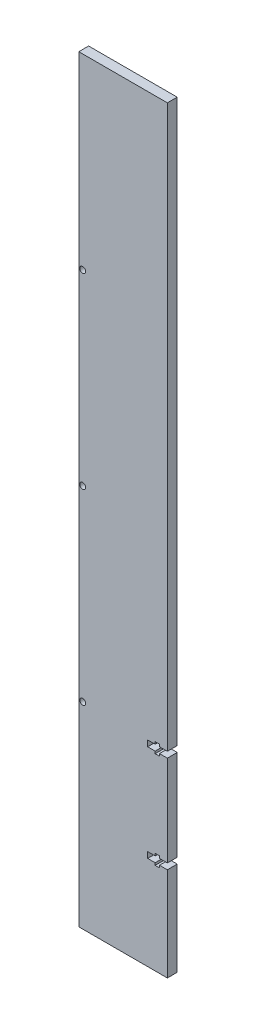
ISO-10303-21;
HEADER;
FILE_DESCRIPTION(('STEP AP214'),'2;1');
FILE_NAME('part.step','',(''),(''),'','','');
FILE_SCHEMA(('AUTOMOTIVE_DESIGN { 1 0 10303 214 1 1 1 1 }'));
ENDSEC;
DATA;
#1=APPLICATION_CONTEXT('core data for automotive mechanical design processes');
#2=APPLICATION_PROTOCOL_DEFINITION('international standard','automotive_design',2000,#1);
#3=PRODUCT_CONTEXT('',#1,'mechanical');
#4=PRODUCT('Part','Part','',(#3));
#5=PRODUCT_RELATED_PRODUCT_CATEGORY('part','',(#4));
#6=PRODUCT_DEFINITION_FORMATION('','',#4);
#7=PRODUCT_DEFINITION_CONTEXT('part definition',#1,'design');
#8=PRODUCT_DEFINITION('design','',#6,#7);
#9=PRODUCT_DEFINITION_SHAPE('','',#8);
#10=(LENGTH_UNIT() NAMED_UNIT(*) SI_UNIT(.MILLI.,.METRE.));
#11=(NAMED_UNIT(*) PLANE_ANGLE_UNIT() SI_UNIT($,.RADIAN.));
#12=(NAMED_UNIT(*) SI_UNIT($,.STERADIAN.) SOLID_ANGLE_UNIT());
#13=UNCERTAINTY_MEASURE_WITH_UNIT(LENGTH_MEASURE(1.E-05),#10,'distance_accuracy_value','');
#14=(GEOMETRIC_REPRESENTATION_CONTEXT(3) GLOBAL_UNCERTAINTY_ASSIGNED_CONTEXT((#13)) GLOBAL_UNIT_ASSIGNED_CONTEXT((#10,
#11,#12)) REPRESENTATION_CONTEXT('',''));
#15=CARTESIAN_POINT('',(0.,0.,0.));
#16=DIRECTION('',(0.,0.,1.));
#17=DIRECTION('',(1.,0.,0.));
#18=AXIS2_PLACEMENT_3D('',#15,#16,#17);
#19=CARTESIAN_POINT('',(18.5,0.,-5.));
#20=DIRECTION('',(1.,0.,0.));
#21=DIRECTION('',(0.,0.,-1.));
#22=AXIS2_PLACEMENT_3D('',#19,#20,#21);
#23=PLANE('',#22);
#24=DIRECTION('',(0.,1.,0.));
#25=VECTOR('',#24,1.);
#26=CARTESIAN_POINT('',(18.5,0.,5.));
#27=LINE('',#26,#25);
#28=CARTESIAN_POINT('',(18.5,-95.7800000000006,5.));
#29=VERTEX_POINT('',#28);
#30=CARTESIAN_POINT('',(18.5,-96.9300000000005,5.));
#31=VERTEX_POINT('',#30);
#32=EDGE_CURVE('E259',#29,#31,#27,.F.);
#33=ORIENTED_EDGE('',*,*,#32,.F.);
#34=DIRECTION('',(0.,0.,1.));
#35=VECTOR('',#34,1.);
#36=CARTESIAN_POINT('',(18.5,-95.7800000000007,-5.));
#37=LINE('',#36,#35);
#38=CARTESIAN_POINT('',(18.5,-95.7800000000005,0.));
#39=VERTEX_POINT('',#38);
#40=EDGE_CURVE('E383',#29,#39,#37,.F.);
#41=ORIENTED_EDGE('',*,*,#40,.T.);
#42=DIRECTION('',(0.,1.,0.));
#43=VECTOR('',#42,1.);
#44=CARTESIAN_POINT('',(18.5,0.,0.));
#45=LINE('',#44,#43);
#46=CARTESIAN_POINT('',(18.5,-96.9300000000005,0.));
#47=VERTEX_POINT('',#46);
#48=EDGE_CURVE('E244',#39,#47,#45,.F.);
#49=ORIENTED_EDGE('',*,*,#48,.T.);
#50=DIRECTION('',(0.,0.,-1.));
#51=VECTOR('',#50,1.);
#52=CARTESIAN_POINT('',(18.5,-96.9300000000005,-5.));
#53=LINE('',#52,#51);
#54=EDGE_CURVE('E377',#47,#31,#53,.F.);
#55=ORIENTED_EDGE('',*,*,#54,.T.);
#56=EDGE_LOOP('',(#33,#41,#49,#55));
#57=FACE_BOUND('',#56,.T.);
#58=ADVANCED_FACE('F25',(#57),#23,.F.);
#59=CARTESIAN_POINT('',(16.2999999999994,0.,-5.));
#60=DIRECTION('',(-1.,0.,0.));
#61=DIRECTION('',(0.,-1.,0.));
#62=AXIS2_PLACEMENT_3D('',#59,#60,#61);
#63=PLANE('',#62);
#64=DIRECTION('',(0.,-1.,0.));
#65=VECTOR('',#64,1.);
#66=CARTESIAN_POINT('',(16.2999999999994,0.,5.));
#67=LINE('',#66,#65);
#68=CARTESIAN_POINT('',(16.3,-96.9300000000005,5.));
#69=VERTEX_POINT('',#68);
#70=CARTESIAN_POINT('',(16.3,-95.7800000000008,5.));
#71=VERTEX_POINT('',#70);
#72=EDGE_CURVE('E257',#69,#71,#67,.F.);
#73=ORIENTED_EDGE('',*,*,#72,.F.);
#74=DIRECTION('',(0.,0.,-1.));
#75=VECTOR('',#74,1.);
#76=CARTESIAN_POINT('',(16.3,-96.9300000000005,-5.));
#77=LINE('',#76,#75);
#78=CARTESIAN_POINT('',(16.3,-96.9300000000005,0.));
#79=VERTEX_POINT('',#78);
#80=EDGE_CURVE('E374',#69,#79,#77,.T.);
#81=ORIENTED_EDGE('',*,*,#80,.T.);
#82=DIRECTION('',(0.,1.,0.));
#83=VECTOR('',#82,1.);
#84=CARTESIAN_POINT('',(16.3,0.,0.));
#85=LINE('',#84,#83);
#86=CARTESIAN_POINT('',(16.3,-95.7800000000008,0.));
#87=VERTEX_POINT('',#86);
#88=EDGE_CURVE('E242',#79,#87,#85,.T.);
#89=ORIENTED_EDGE('',*,*,#88,.T.);
#90=DIRECTION('',(0.,0.,1.));
#91=VECTOR('',#90,1.);
#92=CARTESIAN_POINT('',(16.3,-95.7800000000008,-5.));
#93=LINE('',#92,#91);
#94=EDGE_CURVE('E368',#87,#71,#93,.T.);
#95=ORIENTED_EDGE('',*,*,#94,.T.);
#96=EDGE_LOOP('',(#73,#81,#89,#95));
#97=FACE_BOUND('',#96,.T.);
#98=ADVANCED_FACE('F468',(#97),#63,.F.);
#99=CARTESIAN_POINT('',(16.2999999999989,1.9670255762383E-13,-5.));
#100=DIRECTION('',(-1.,0.,0.));
#101=DIRECTION('',(0.,-1.,0.));
#102=AXIS2_PLACEMENT_3D('',#99,#100,#101);
#103=PLANE('',#102);
#104=DIRECTION('',(0.,-1.,0.));
#105=VECTOR('',#104,1.);
#106=CARTESIAN_POINT('',(16.2999999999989,1.9670255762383E-13,5.));
#107=LINE('',#106,#105);
#108=CARTESIAN_POINT('',(16.3,-92.7800000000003,5.));
#109=VERTEX_POINT('',#108);
#110=CARTESIAN_POINT('',(16.3,-91.6300000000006,5.));
#111=VERTEX_POINT('',#110);
#112=EDGE_CURVE('E255',#109,#111,#107,.F.);
#113=ORIENTED_EDGE('',*,*,#112,.F.);
#114=DIRECTION('',(0.,0.,1.));
#115=VECTOR('',#114,1.);
#116=CARTESIAN_POINT('',(16.3,-92.7800000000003,-5.));
#117=LINE('',#116,#115);
#118=CARTESIAN_POINT('',(16.3,-92.7800000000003,0.));
#119=VERTEX_POINT('',#118);
#120=EDGE_CURVE('E357',#109,#119,#117,.F.);
#121=ORIENTED_EDGE('',*,*,#120,.T.);
#122=DIRECTION('',(0.,1.,0.));
#123=VECTOR('',#122,1.);
#124=CARTESIAN_POINT('',(16.3,0.,0.));
#125=LINE('',#124,#123);
#126=CARTESIAN_POINT('',(16.3,-91.6300000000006,0.));
#127=VERTEX_POINT('',#126);
#128=EDGE_CURVE('E240',#119,#127,#125,.T.);
#129=ORIENTED_EDGE('',*,*,#128,.T.);
#130=DIRECTION('',(0.,0.,1.));
#131=VECTOR('',#130,1.);
#132=CARTESIAN_POINT('',(16.3,-91.6300000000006,-5.));
#133=LINE('',#132,#131);
#134=EDGE_CURVE('E351',#127,#111,#133,.T.);
#135=ORIENTED_EDGE('',*,*,#134,.T.);
#136=EDGE_LOOP('',(#113,#121,#129,#135));
#137=FACE_BOUND('',#136,.T.);
#138=ADVANCED_FACE('F484',(#137),#103,.F.);
#139=CARTESIAN_POINT('',(18.5,0.,-5.));
#140=DIRECTION('',(1.,0.,0.));
#141=DIRECTION('',(0.,0.,-1.));
#142=AXIS2_PLACEMENT_3D('',#139,#140,#141);
#143=PLANE('',#142);
#144=DIRECTION('',(0.,1.,0.));
#145=VECTOR('',#144,1.);
#146=CARTESIAN_POINT('',(18.5,0.,5.));
#147=LINE('',#146,#145);
#148=CARTESIAN_POINT('',(18.5,-91.6300000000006,5.));
#149=VERTEX_POINT('',#148);
#150=CARTESIAN_POINT('',(18.5,-92.7800000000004,5.));
#151=VERTEX_POINT('',#150);
#152=EDGE_CURVE('E253',#149,#151,#147,.F.);
#153=ORIENTED_EDGE('',*,*,#152,.F.);
#154=DIRECTION('',(0.,0.,1.));
#155=VECTOR('',#154,1.);
#156=CARTESIAN_POINT('',(18.5,-91.6300000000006,-5.));
#157=LINE('',#156,#155);
#158=CARTESIAN_POINT('',(18.5,-91.6300000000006,0.));
#159=VERTEX_POINT('',#158);
#160=EDGE_CURVE('E348',#149,#159,#157,.F.);
#161=ORIENTED_EDGE('',*,*,#160,.T.);
#162=DIRECTION('',(0.,1.,0.));
#163=VECTOR('',#162,1.);
#164=CARTESIAN_POINT('',(18.5,0.,0.));
#165=LINE('',#164,#163);
#166=CARTESIAN_POINT('',(18.5,-92.7800000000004,0.));
#167=VERTEX_POINT('',#166);
#168=EDGE_CURVE('E238',#159,#167,#165,.F.);
#169=ORIENTED_EDGE('',*,*,#168,.T.);
#170=DIRECTION('',(0.,0.,1.));
#171=VECTOR('',#170,1.);
#172=CARTESIAN_POINT('',(18.5,-92.7800000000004,-5.));
#173=LINE('',#172,#171);
#174=EDGE_CURVE('E342',#167,#151,#173,.T.);
#175=ORIENTED_EDGE('',*,*,#174,.T.);
#176=EDGE_LOOP('',(#153,#161,#169,#175));
#177=FACE_BOUND('',#176,.T.);
#178=ADVANCED_FACE('F494',(#177),#143,.F.);
#179=CARTESIAN_POINT('',(18.5,0.,-5.));
#180=DIRECTION('',(1.,0.,0.));
#181=DIRECTION('',(0.,0.,-1.));
#182=AXIS2_PLACEMENT_3D('',#179,#180,#181);
#183=PLANE('',#182);
#184=DIRECTION('',(0.,1.,0.));
#185=VECTOR('',#184,1.);
#186=CARTESIAN_POINT('',(18.5,0.,5.));
#187=LINE('',#186,#185);
#188=CARTESIAN_POINT('',(18.5,-144.890000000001,5.));
#189=VERTEX_POINT('',#188);
#190=CARTESIAN_POINT('',(18.5,-146.040000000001,5.));
#191=VERTEX_POINT('',#190);
#192=EDGE_CURVE('E251',#189,#191,#187,.F.);
#193=ORIENTED_EDGE('',*,*,#192,.F.);
#194=DIRECTION('',(0.,0.,1.));
#195=VECTOR('',#194,1.);
#196=CARTESIAN_POINT('',(18.5,-144.890000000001,-5.));
#197=LINE('',#196,#195);
#198=CARTESIAN_POINT('',(18.5,-144.890000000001,0.));
#199=VERTEX_POINT('',#198);
#200=EDGE_CURVE('E311',#189,#199,#197,.F.);
#201=ORIENTED_EDGE('',*,*,#200,.T.);
#202=DIRECTION('',(0.,1.,0.));
#203=VECTOR('',#202,1.);
#204=CARTESIAN_POINT('',(18.5,0.,0.));
#205=LINE('',#204,#203);
#206=CARTESIAN_POINT('',(18.5,-146.040000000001,0.));
#207=VERTEX_POINT('',#206);
#208=EDGE_CURVE('E236',#199,#207,#205,.F.);
#209=ORIENTED_EDGE('',*,*,#208,.T.);
#210=DIRECTION('',(0.,0.,-1.));
#211=VECTOR('',#210,1.);
#212=CARTESIAN_POINT('',(18.5,-146.040000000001,-5.));
#213=LINE('',#212,#211);
#214=EDGE_CURVE('E305',#207,#191,#213,.F.);
#215=ORIENTED_EDGE('',*,*,#214,.T.);
#216=EDGE_LOOP('',(#193,#201,#209,#215));
#217=FACE_BOUND('',#216,.T.);
#218=ADVANCED_FACE('F526',(#217),#183,.F.);
#219=CARTESIAN_POINT('',(16.2999999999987,1.47526918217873E-13,-5.));
#220=DIRECTION('',(-1.,0.,0.));
#221=DIRECTION('',(0.,-1.,0.));
#222=AXIS2_PLACEMENT_3D('',#219,#220,#221);
#223=PLANE('',#222);
#224=DIRECTION('',(0.,-1.,0.));
#225=VECTOR('',#224,1.);
#226=CARTESIAN_POINT('',(16.2999999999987,1.47526918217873E-13,5.));
#227=LINE('',#226,#225);
#228=CARTESIAN_POINT('',(16.3,-146.040000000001,5.));
#229=VERTEX_POINT('',#228);
#230=CARTESIAN_POINT('',(16.3,-144.890000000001,5.));
#231=VERTEX_POINT('',#230);
#232=EDGE_CURVE('E249',#229,#231,#227,.F.);
#233=ORIENTED_EDGE('',*,*,#232,.F.);
#234=DIRECTION('',(0.,0.,-1.));
#235=VECTOR('',#234,1.);
#236=CARTESIAN_POINT('',(16.3,-146.040000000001,-5.));
#237=LINE('',#236,#235);
#238=CARTESIAN_POINT('',(16.3,-146.040000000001,0.));
#239=VERTEX_POINT('',#238);
#240=EDGE_CURVE('E302',#229,#239,#237,.T.);
#241=ORIENTED_EDGE('',*,*,#240,.T.);
#242=DIRECTION('',(0.,1.,0.));
#243=VECTOR('',#242,1.);
#244=CARTESIAN_POINT('',(16.3,0.,0.));
#245=LINE('',#244,#243);
#246=CARTESIAN_POINT('',(16.3,-144.890000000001,0.));
#247=VERTEX_POINT('',#246);
#248=EDGE_CURVE('E234',#239,#247,#245,.T.);
#249=ORIENTED_EDGE('',*,*,#248,.T.);
#250=DIRECTION('',(0.,0.,1.));
#251=VECTOR('',#250,1.);
#252=CARTESIAN_POINT('',(16.3,-144.890000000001,-5.));
#253=LINE('',#252,#251);
#254=EDGE_CURVE('E296',#247,#231,#253,.T.);
#255=ORIENTED_EDGE('',*,*,#254,.T.);
#256=EDGE_LOOP('',(#233,#241,#249,#255));
#257=FACE_BOUND('',#256,.T.);
#258=ADVANCED_FACE('F534',(#257),#223,.F.);
#259=CARTESIAN_POINT('',(16.2999999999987,1.47526918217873E-13,-5.));
#260=DIRECTION('',(-1.,0.,0.));
#261=DIRECTION('',(0.,-1.,0.));
#262=AXIS2_PLACEMENT_3D('',#259,#260,#261);
#263=PLANE('',#262);
#264=DIRECTION('',(0.,-1.,0.));
#265=VECTOR('',#264,1.);
#266=CARTESIAN_POINT('',(16.2999999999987,1.47526918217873E-13,5.));
#267=LINE('',#266,#265);
#268=CARTESIAN_POINT('',(16.3,-141.89,5.));
#269=VERTEX_POINT('',#268);
#270=CARTESIAN_POINT('',(16.3,-140.740000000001,5.));
#271=VERTEX_POINT('',#270);
#272=EDGE_CURVE('E247',#269,#271,#267,.F.);
#273=ORIENTED_EDGE('',*,*,#272,.F.);
#274=DIRECTION('',(0.,0.,1.));
#275=VECTOR('',#274,1.);
#276=CARTESIAN_POINT('',(16.3,-141.89,-5.));
#277=LINE('',#276,#275);
#278=CARTESIAN_POINT('',(16.3,-141.89,0.));
#279=VERTEX_POINT('',#278);
#280=EDGE_CURVE('E285',#269,#279,#277,.F.);
#281=ORIENTED_EDGE('',*,*,#280,.T.);
#282=DIRECTION('',(0.,1.,0.));
#283=VECTOR('',#282,1.);
#284=CARTESIAN_POINT('',(16.3,0.,0.));
#285=LINE('',#284,#283);
#286=CARTESIAN_POINT('',(16.3,-140.740000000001,0.));
#287=VERTEX_POINT('',#286);
#288=EDGE_CURVE('E219',#279,#287,#285,.T.);
#289=ORIENTED_EDGE('',*,*,#288,.T.);
#290=DIRECTION('',(0.,0.,1.));
#291=VECTOR('',#290,1.);
#292=CARTESIAN_POINT('',(16.3,-140.740000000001,-5.));
#293=LINE('',#292,#291);
#294=EDGE_CURVE('E276',#287,#271,#293,.T.);
#295=ORIENTED_EDGE('',*,*,#294,.T.);
#296=EDGE_LOOP('',(#273,#281,#289,#295));
#297=FACE_BOUND('',#296,.T.);
#298=ADVANCED_FACE('F552',(#297),#263,.F.);
#299=CARTESIAN_POINT('',(18.5000000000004,0.,-5.));
#300=DIRECTION('',(1.,0.,0.));
#301=DIRECTION('',(0.,1.,0.));
#302=AXIS2_PLACEMENT_3D('',#299,#300,#301);
#303=PLANE('',#302);
#304=DIRECTION('',(0.,1.,0.));
#305=VECTOR('',#304,1.);
#306=CARTESIAN_POINT('',(18.5000000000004,0.,5.));
#307=LINE('',#306,#305);
#308=CARTESIAN_POINT('',(18.5,-140.740000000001,5.));
#309=VERTEX_POINT('',#308);
#310=CARTESIAN_POINT('',(18.5,-141.89,5.));
#311=VERTEX_POINT('',#310);
#312=EDGE_CURVE('E43',#309,#311,#307,.F.);
#313=ORIENTED_EDGE('',*,*,#312,.F.);
#314=DIRECTION('',(0.,0.,1.));
#315=VECTOR('',#314,1.);
#316=CARTESIAN_POINT('',(18.5,-140.740000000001,-5.));
#317=LINE('',#316,#315);
#318=CARTESIAN_POINT('',(18.5,-140.740000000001,0.));
#319=VERTEX_POINT('',#318);
#320=EDGE_CURVE('E215',#309,#319,#317,.F.);
#321=ORIENTED_EDGE('',*,*,#320,.T.);
#322=DIRECTION('',(0.,1.,0.));
#323=VECTOR('',#322,1.);
#324=CARTESIAN_POINT('',(18.5,0.,0.));
#325=LINE('',#324,#323);
#326=CARTESIAN_POINT('',(18.5,-141.89,0.));
#327=VERTEX_POINT('',#326);
#328=EDGE_CURVE('E210',#319,#327,#325,.F.);
#329=ORIENTED_EDGE('',*,*,#328,.T.);
#330=DIRECTION('',(0.,0.,1.));
#331=VECTOR('',#330,1.);
#332=CARTESIAN_POINT('',(18.5,-141.89,-5.));
#333=LINE('',#332,#331);
#334=EDGE_CURVE('E213',#327,#311,#333,.T.);
#335=ORIENTED_EDGE('',*,*,#334,.T.);
#336=EDGE_LOOP('',(#313,#321,#329,#335));
#337=FACE_BOUND('',#336,.T.);
#338=ADVANCED_FACE('F211',(#337),#303,.F.);
#339=CARTESIAN_POINT('',(0.,0.,0.));
#340=DIRECTION('',(0.,0.,1.));
#341=DIRECTION('',(1.,0.,0.));
#342=AXIS2_PLACEMENT_3D('',#339,#340,#341);
#343=PLANE('',#342);
#344=CARTESIAN_POINT('',(-20.5,2.50000000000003,0.));
#345=DIRECTION('',(0.,0.,-1.));
#346=DIRECTION('',(-1.,0.,0.));
#347=AXIS2_PLACEMENT_3D('',#344,#345,#346);
#348=CIRCLE('',#347,1.50000000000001);
#349=CARTESIAN_POINT('',(-22.,2.50000000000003,0.));
#350=VERTEX_POINT('',#349);
#351=EDGE_CURVE('E267',#350,#350,#348,.F.);
#352=ORIENTED_EDGE('',*,*,#351,.T.);
#353=EDGE_LOOP('',(#352));
#354=FACE_BOUND('',#353,.T.);
#355=CARTESIAN_POINT('',(-20.5,97.5,0.));
#356=DIRECTION('',(0.,0.,-1.));
#357=DIRECTION('',(-1.,0.,0.));
#358=AXIS2_PLACEMENT_3D('',#355,#356,#357);
#359=CIRCLE('',#358,1.50000000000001);
#360=CARTESIAN_POINT('',(-22.,97.5,0.));
#361=VERTEX_POINT('',#360);
#362=EDGE_CURVE('E269',#361,#361,#359,.F.);
#363=ORIENTED_EDGE('',*,*,#362,.T.);
#364=EDGE_LOOP('',(#363));
#365=FACE_BOUND('',#364,.T.);
#366=CARTESIAN_POINT('',(-20.5,-92.5,0.));
#367=DIRECTION('',(0.,0.,-1.));
#368=DIRECTION('',(-1.,0.,0.));
#369=AXIS2_PLACEMENT_3D('',#366,#367,#368);
#370=CIRCLE('',#369,1.5);
#371=CARTESIAN_POINT('',(-22.,-92.5,0.));
#372=VERTEX_POINT('',#371);
#373=EDGE_CURVE('E28',#372,#372,#370,.F.);
#374=ORIENTED_EDGE('',*,*,#373,.T.);
#375=EDGE_LOOP('',(#374));
#376=FACE_BOUND('',#375,.T.);
#377=DIRECTION('',(-1.,-1.73472347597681E-13,0.));
#378=VECTOR('',#377,1.);
#379=CARTESIAN_POINT('',(2.46139914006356E-11,-141.890000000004,0.));
#380=LINE('',#379,#378);
#381=CARTESIAN_POINT('',(22.5,-141.89,0.));
#382=VERTEX_POINT('',#381);
#383=EDGE_CURVE('E218',#382,#327,#380,.T.);
#384=ORIENTED_EDGE('',*,*,#383,.T.);
#385=ORIENTED_EDGE('',*,*,#328,.F.);
#386=DIRECTION('',(1.,0.,0.));
#387=VECTOR('',#386,1.);
#388=CARTESIAN_POINT('',(0.,-140.740000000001,0.));
#389=LINE('',#388,#387);
#390=EDGE_CURVE('E279',#319,#287,#389,.F.);
#391=ORIENTED_EDGE('',*,*,#390,.T.);
#392=ORIENTED_EDGE('',*,*,#288,.F.);
#393=DIRECTION('',(-1.,0.,0.));
#394=VECTOR('',#393,1.);
#395=CARTESIAN_POINT('',(1.0363785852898E-12,-141.89,0.));
#396=LINE('',#395,#394);
#397=CARTESIAN_POINT('',(12.4999999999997,-141.89,0.));
#398=VERTEX_POINT('',#397);
#399=EDGE_CURVE('E290',#279,#398,#396,.T.);
#400=ORIENTED_EDGE('',*,*,#399,.T.);
#401=DIRECTION('',(0.,-1.,0.));
#402=VECTOR('',#401,1.);
#403=CARTESIAN_POINT('',(12.4999999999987,0.,0.));
#404=LINE('',#403,#402);
#405=CARTESIAN_POINT('',(12.4999999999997,-144.890000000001,0.));
#406=VERTEX_POINT('',#405);
#407=EDGE_CURVE('E294',#398,#406,#404,.T.);
#408=ORIENTED_EDGE('',*,*,#407,.T.);
#409=DIRECTION('',(1.,0.,0.));
#410=VECTOR('',#409,1.);
#411=CARTESIAN_POINT('',(1.05829088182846E-12,-144.890000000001,0.));
#412=LINE('',#411,#410);
#413=EDGE_CURVE('E299',#406,#247,#412,.T.);
#414=ORIENTED_EDGE('',*,*,#413,.T.);
#415=ORIENTED_EDGE('',*,*,#248,.F.);
#416=DIRECTION('',(1.,0.,0.));
#417=VECTOR('',#416,1.);
#418=CARTESIAN_POINT('',(0.,-146.040000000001,0.));
#419=LINE('',#418,#417);
#420=EDGE_CURVE('E308',#239,#207,#419,.T.);
#421=ORIENTED_EDGE('',*,*,#420,.T.);
#422=ORIENTED_EDGE('',*,*,#208,.F.);
#423=DIRECTION('',(1.,1.17961196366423E-13,0.));
#424=VECTOR('',#423,1.);
#425=CARTESIAN_POINT('',(1.70913977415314E-11,-144.890000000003,0.));
#426=LINE('',#425,#424);
#427=CARTESIAN_POINT('',(22.5,-144.89,0.));
#428=VERTEX_POINT('',#427);
#429=EDGE_CURVE('E316',#199,#428,#426,.T.);
#430=ORIENTED_EDGE('',*,*,#429,.T.);
#431=DIRECTION('',(0.,-1.,0.));
#432=VECTOR('',#431,1.);
#433=CARTESIAN_POINT('',(22.5,192.5,0.));
#434=LINE('',#433,#432);
#435=CARTESIAN_POINT('',(22.5,-192.5,0.));
#436=VERTEX_POINT('',#435);
#437=EDGE_CURVE('E318',#428,#436,#434,.T.);
#438=ORIENTED_EDGE('',*,*,#437,.T.);
#439=DIRECTION('',(1.,0.,0.));
#440=VECTOR('',#439,1.);
#441=CARTESIAN_POINT('',(-22.5,-192.5,0.));
#442=LINE('',#441,#440);
#443=CARTESIAN_POINT('',(-22.5,-192.5,0.));
#444=VERTEX_POINT('',#443);
#445=EDGE_CURVE('E323',#436,#444,#442,.F.);
#446=ORIENTED_EDGE('',*,*,#445,.T.);
#447=DIRECTION('',(0.,1.,0.));
#448=VECTOR('',#447,1.);
#449=CARTESIAN_POINT('',(-22.5,192.5,0.));
#450=LINE('',#449,#448);
#451=CARTESIAN_POINT('',(-22.5,192.5,0.));
#452=VERTEX_POINT('',#451);
#453=EDGE_CURVE('E328',#444,#452,#450,.T.);
#454=ORIENTED_EDGE('',*,*,#453,.T.);
#455=DIRECTION('',(1.,0.,0.));
#456=VECTOR('',#455,1.);
#457=CARTESIAN_POINT('',(-22.5,192.5,0.));
#458=LINE('',#457,#456);
#459=CARTESIAN_POINT('',(22.5,192.5,0.));
#460=VERTEX_POINT('',#459);
#461=EDGE_CURVE('E333',#452,#460,#458,.T.);
#462=ORIENTED_EDGE('',*,*,#461,.T.);
#463=DIRECTION('',(0.,-1.,0.));
#464=VECTOR('',#463,1.);
#465=CARTESIAN_POINT('',(22.5,192.5,0.));
#466=LINE('',#465,#464);
#467=CARTESIAN_POINT('',(22.5,-92.7800000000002,0.));
#468=VERTEX_POINT('',#467);
#469=EDGE_CURVE('E340',#460,#468,#466,.T.);
#470=ORIENTED_EDGE('',*,*,#469,.T.);
#471=DIRECTION('',(-1.,-1.73472347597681E-13,0.));
#472=VECTOR('',#471,1.);
#473=CARTESIAN_POINT('',(1.60947644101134E-11,-92.7800000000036,0.));
#474=LINE('',#473,#472);
#475=EDGE_CURVE('E345',#468,#167,#474,.T.);
#476=ORIENTED_EDGE('',*,*,#475,.T.);
#477=ORIENTED_EDGE('',*,*,#168,.F.);
#478=DIRECTION('',(1.,0.,0.));
#479=VECTOR('',#478,1.);
#480=CARTESIAN_POINT('',(0.,-91.6300000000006,0.));
#481=LINE('',#480,#479);
#482=EDGE_CURVE('E354',#159,#127,#481,.F.);
#483=ORIENTED_EDGE('',*,*,#482,.T.);
#484=ORIENTED_EDGE('',*,*,#128,.F.);
#485=DIRECTION('',(-1.,0.,0.));
#486=VECTOR('',#485,1.);
#487=CARTESIAN_POINT('',(6.77674290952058E-13,-92.7800000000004,0.));
#488=LINE('',#487,#486);
#489=CARTESIAN_POINT('',(12.4999999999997,-92.7800000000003,0.));
#490=VERTEX_POINT('',#489);
#491=EDGE_CURVE('E362',#119,#490,#488,.T.);
#492=ORIENTED_EDGE('',*,*,#491,.T.);
#493=DIRECTION('',(0.,-1.,0.));
#494=VECTOR('',#493,1.);
#495=CARTESIAN_POINT('',(12.4999999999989,1.0119220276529E-13,0.));
#496=LINE('',#495,#494);
#497=CARTESIAN_POINT('',(12.4999999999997,-95.7800000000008,0.));
#498=VERTEX_POINT('',#497);
#499=EDGE_CURVE('E366',#490,#498,#496,.T.);
#500=ORIENTED_EDGE('',*,*,#499,.T.);
#501=DIRECTION('',(1.,0.,0.));
#502=VECTOR('',#501,1.);
#503=CARTESIAN_POINT('',(6.99586587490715E-13,-95.7800000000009,0.));
#504=LINE('',#503,#502);
#505=EDGE_CURVE('E371',#498,#87,#504,.T.);
#506=ORIENTED_EDGE('',*,*,#505,.T.);
#507=ORIENTED_EDGE('',*,*,#88,.F.);
#508=DIRECTION('',(1.,0.,0.));
#509=VECTOR('',#508,1.);
#510=CARTESIAN_POINT('',(0.,-96.9300000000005,0.));
#511=LINE('',#510,#509);
#512=EDGE_CURVE('E380',#79,#47,#511,.T.);
#513=ORIENTED_EDGE('',*,*,#512,.T.);
#514=ORIENTED_EDGE('',*,*,#48,.F.);
#515=DIRECTION('',(1.,1.17961196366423E-13,0.));
#516=VECTOR('',#515,1.);
#517=CARTESIAN_POINT('',(1.12983233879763E-11,-95.7800000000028,0.));
#518=LINE('',#517,#516);
#519=CARTESIAN_POINT('',(22.5,-95.7800000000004,0.));
#520=VERTEX_POINT('',#519);
#521=EDGE_CURVE('E388',#39,#520,#518,.T.);
#522=ORIENTED_EDGE('',*,*,#521,.T.);
#523=DIRECTION('',(0.,-1.,0.));
#524=VECTOR('',#523,1.);
#525=CARTESIAN_POINT('',(22.5,192.5,0.));
#526=LINE('',#525,#524);
#527=EDGE_CURVE('E207',#520,#382,#526,.T.);
#528=ORIENTED_EDGE('',*,*,#527,.T.);
#529=EDGE_LOOP('',(#384,#385,#391,#392,#400,#408,#414,#415,#421,#422,#430,#438,#446,#454,#462,
#470,#476,#477,#483,#484,#492,#500,#506,#507,#513,#514,#522,#528));
#530=FACE_BOUND('',#529,.T.);
#531=ADVANCED_FACE('F221',(#354,#365,#376,#530),#343,.F.);
#532=CARTESIAN_POINT('',(2.46139914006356E-11,-141.890000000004,-5.));
#533=DIRECTION('',(-1.73472347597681E-13,1.,0.));
#534=DIRECTION('',(-1.,-1.73472347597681E-13,0.));
#535=AXIS2_PLACEMENT_3D('',#532,#533,#534);
#536=PLANE('',#535);
#537=DIRECTION('',(1.,0.,0.));
#538=VECTOR('',#537,1.);
#539=CARTESIAN_POINT('',(0.,-141.89,5.));
#540=LINE('',#539,#538);
#541=CARTESIAN_POINT('',(22.5,-141.89,5.));
#542=VERTEX_POINT('',#541);
#543=EDGE_CURVE('E227',#311,#542,#540,.T.);
#544=ORIENTED_EDGE('',*,*,#543,.F.);
#545=ORIENTED_EDGE('',*,*,#334,.F.);
#546=ORIENTED_EDGE('',*,*,#383,.F.);
#547=DIRECTION('',(0.,0.,1.));
#548=VECTOR('',#547,1.);
#549=CARTESIAN_POINT('',(22.5,-141.89,5.));
#550=LINE('',#549,#548);
#551=EDGE_CURVE('E229',#382,#542,#550,.T.);
#552=ORIENTED_EDGE('',*,*,#551,.T.);
#553=EDGE_LOOP('',(#544,#545,#546,#552));
#554=FACE_BOUND('',#553,.T.);
#555=ADVANCED_FACE('F225',(#554),#536,.F.);
#556=CARTESIAN_POINT('',(22.5,192.5,5.));
#557=DIRECTION('',(-1.,0.,0.));
#558=DIRECTION('',(0.,-1.,0.));
#559=AXIS2_PLACEMENT_3D('',#556,#557,#558);
#560=PLANE('',#559);
#561=ORIENTED_EDGE('',*,*,#551,.F.);
#562=ORIENTED_EDGE('',*,*,#527,.F.);
#563=DIRECTION('',(0.,0.,1.));
#564=VECTOR('',#563,1.);
#565=CARTESIAN_POINT('',(22.5,-95.7800000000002,-5.));
#566=LINE('',#565,#564);
#567=CARTESIAN_POINT('',(22.5,-95.7800000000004,5.));
#568=VERTEX_POINT('',#567);
#569=EDGE_CURVE('E386',#520,#568,#566,.T.);
#570=ORIENTED_EDGE('',*,*,#569,.T.);
#571=DIRECTION('',(0.,1.,0.));
#572=VECTOR('',#571,1.);
#573=CARTESIAN_POINT('',(22.5,0.,5.));
#574=LINE('',#573,#572);
#575=EDGE_CURVE('E392',#542,#568,#574,.T.);
#576=ORIENTED_EDGE('',*,*,#575,.F.);
#577=EDGE_LOOP('',(#561,#562,#570,#576));
#578=FACE_BOUND('',#577,.T.);
#579=ADVANCED_FACE('F393',(#578),#560,.F.);
#580=CARTESIAN_POINT('',(1.12983233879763E-11,-95.7800000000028,-5.));
#581=DIRECTION('',(1.17961196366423E-13,-1.,0.));
#582=DIRECTION('',(1.,1.17961196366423E-13,0.));
#583=AXIS2_PLACEMENT_3D('',#580,#581,#582);
#584=PLANE('',#583);
#585=DIRECTION('',(1.,0.,0.));
#586=VECTOR('',#585,1.);
#587=CARTESIAN_POINT('',(0.,-95.7800000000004,5.));
#588=LINE('',#587,#586);
#589=EDGE_CURVE('E398',#568,#29,#588,.F.);
#590=ORIENTED_EDGE('',*,*,#589,.F.);
#591=ORIENTED_EDGE('',*,*,#569,.F.);
#592=ORIENTED_EDGE('',*,*,#521,.F.);
#593=ORIENTED_EDGE('',*,*,#40,.F.);
#594=EDGE_LOOP('',(#590,#591,#592,#593));
#595=FACE_BOUND('',#594,.T.);
#596=ADVANCED_FACE('F456',(#595),#584,.F.);
#597=CARTESIAN_POINT('',(0.,-96.9300000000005,-5.));
#598=DIRECTION('',(0.,-1.,0.));
#599=DIRECTION('',(0.,0.,-1.));
#600=AXIS2_PLACEMENT_3D('',#597,#598,#599);
#601=PLANE('',#600);
#602=DIRECTION('',(1.,0.,0.));
#603=VECTOR('',#602,1.);
#604=CARTESIAN_POINT('',(0.,-96.9300000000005,5.));
#605=LINE('',#604,#603);
#606=EDGE_CURVE('E451',#31,#69,#605,.F.);
#607=ORIENTED_EDGE('',*,*,#606,.F.);
#608=ORIENTED_EDGE('',*,*,#54,.F.);
#609=ORIENTED_EDGE('',*,*,#512,.F.);
#610=ORIENTED_EDGE('',*,*,#80,.F.);
#611=EDGE_LOOP('',(#607,#608,#609,#610));
#612=FACE_BOUND('',#611,.T.);
#613=ADVANCED_FACE('F464',(#612),#601,.F.);
#614=CARTESIAN_POINT('',(6.99586587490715E-13,-95.7800000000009,-5.));
#615=DIRECTION('',(0.,-1.,0.));
#616=DIRECTION('',(1.,0.,0.));
#617=AXIS2_PLACEMENT_3D('',#614,#615,#616);
#618=PLANE('',#617);
#619=DIRECTION('',(1.,0.,0.));
#620=VECTOR('',#619,1.);
#621=CARTESIAN_POINT('',(0.,-95.7800000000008,5.));
#622=LINE('',#621,#620);
#623=CARTESIAN_POINT('',(12.4999999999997,-95.7800000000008,5.));
#624=VERTEX_POINT('',#623);
#625=EDGE_CURVE('E448',#71,#624,#622,.F.);
#626=ORIENTED_EDGE('',*,*,#625,.F.);
#627=ORIENTED_EDGE('',*,*,#94,.F.);
#628=ORIENTED_EDGE('',*,*,#505,.F.);
#629=DIRECTION('',(0.,0.,1.));
#630=VECTOR('',#629,1.);
#631=CARTESIAN_POINT('',(12.4999999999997,-95.7800000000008,-5.));
#632=LINE('',#631,#630);
#633=EDGE_CURVE('E364',#498,#624,#632,.T.);
#634=ORIENTED_EDGE('',*,*,#633,.T.);
#635=EDGE_LOOP('',(#626,#627,#628,#634));
#636=FACE_BOUND('',#635,.T.);
#637=ADVANCED_FACE('F471',(#636),#618,.F.);
#638=CARTESIAN_POINT('',(12.4999999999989,1.0119220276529E-13,-5.));
#639=DIRECTION('',(-1.,0.,0.));
#640=DIRECTION('',(0.,-1.,0.));
#641=AXIS2_PLACEMENT_3D('',#638,#639,#640);
#642=PLANE('',#641);
#643=DIRECTION('',(0.,1.,0.));
#644=VECTOR('',#643,1.);
#645=CARTESIAN_POINT('',(12.4999999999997,0.,5.));
#646=LINE('',#645,#644);
#647=CARTESIAN_POINT('',(12.4999999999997,-92.7800000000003,5.));
#648=VERTEX_POINT('',#647);
#649=EDGE_CURVE('E445',#624,#648,#646,.T.);
#650=ORIENTED_EDGE('',*,*,#649,.F.);
#651=ORIENTED_EDGE('',*,*,#633,.F.);
#652=ORIENTED_EDGE('',*,*,#499,.F.);
#653=DIRECTION('',(0.,0.,1.));
#654=VECTOR('',#653,1.);
#655=CARTESIAN_POINT('',(12.4999999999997,-92.7800000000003,-5.));
#656=LINE('',#655,#654);
#657=EDGE_CURVE('E360',#490,#648,#656,.T.);
#658=ORIENTED_EDGE('',*,*,#657,.T.);
#659=EDGE_LOOP('',(#650,#651,#652,#658));
#660=FACE_BOUND('',#659,.T.);
#661=ADVANCED_FACE('F476',(#660),#642,.F.);
#662=CARTESIAN_POINT('',(6.77674290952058E-13,-92.7800000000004,-5.));
#663=DIRECTION('',(0.,1.,0.));
#664=DIRECTION('',(-1.,0.,0.));
#665=AXIS2_PLACEMENT_3D('',#662,#663,#664);
#666=PLANE('',#665);
#667=DIRECTION('',(1.,0.,0.));
#668=VECTOR('',#667,1.);
#669=CARTESIAN_POINT('',(0.,-92.7800000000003,5.));
#670=LINE('',#669,#668);
#671=EDGE_CURVE('E442',#648,#109,#670,.T.);
#672=ORIENTED_EDGE('',*,*,#671,.F.);
#673=ORIENTED_EDGE('',*,*,#657,.F.);
#674=ORIENTED_EDGE('',*,*,#491,.F.);
#675=ORIENTED_EDGE('',*,*,#120,.F.);
#676=EDGE_LOOP('',(#672,#673,#674,#675));
#677=FACE_BOUND('',#676,.T.);
#678=ADVANCED_FACE('F481',(#677),#666,.F.);
#679=CARTESIAN_POINT('',(0.,-91.6300000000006,-5.));
#680=DIRECTION('',(0.,1.,0.));
#681=DIRECTION('',(0.,0.,1.));
#682=AXIS2_PLACEMENT_3D('',#679,#680,#681);
#683=PLANE('',#682);
#684=DIRECTION('',(1.,0.,0.));
#685=VECTOR('',#684,1.);
#686=CARTESIAN_POINT('',(0.,-91.6300000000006,5.));
#687=LINE('',#686,#685);
#688=EDGE_CURVE('E439',#111,#149,#687,.T.);
#689=ORIENTED_EDGE('',*,*,#688,.F.);
#690=ORIENTED_EDGE('',*,*,#134,.F.);
#691=ORIENTED_EDGE('',*,*,#482,.F.);
#692=ORIENTED_EDGE('',*,*,#160,.F.);
#693=EDGE_LOOP('',(#689,#690,#691,#692));
#694=FACE_BOUND('',#693,.T.);
#695=ADVANCED_FACE('F490',(#694),#683,.F.);
#696=CARTESIAN_POINT('',(1.60947644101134E-11,-92.7800000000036,-5.));
#697=DIRECTION('',(-1.73472347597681E-13,1.,0.));
#698=DIRECTION('',(-1.,-1.73472347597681E-13,0.));
#699=AXIS2_PLACEMENT_3D('',#696,#697,#698);
#700=PLANE('',#699);
#701=DIRECTION('',(1.,0.,0.));
#702=VECTOR('',#701,1.);
#703=CARTESIAN_POINT('',(0.,-92.7800000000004,5.));
#704=LINE('',#703,#702);
#705=CARTESIAN_POINT('',(22.5,-92.78,5.));
#706=VERTEX_POINT('',#705);
#707=EDGE_CURVE('E436',#151,#706,#704,.T.);
#708=ORIENTED_EDGE('',*,*,#707,.F.);
#709=ORIENTED_EDGE('',*,*,#174,.F.);
#710=ORIENTED_EDGE('',*,*,#475,.F.);
#711=DIRECTION('',(0.,0.,1.));
#712=VECTOR('',#711,1.);
#713=CARTESIAN_POINT('',(22.5,-92.7800000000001,5.));
#714=LINE('',#713,#712);
#715=EDGE_CURVE('E338',#468,#706,#714,.T.);
#716=ORIENTED_EDGE('',*,*,#715,.T.);
#717=EDGE_LOOP('',(#708,#709,#710,#716));
#718=FACE_BOUND('',#717,.T.);
#719=ADVANCED_FACE('F497',(#718),#700,.F.);
#720=CARTESIAN_POINT('',(22.5,192.5,5.));
#721=DIRECTION('',(-1.,0.,0.));
#722=DIRECTION('',(0.,-1.,0.));
#723=AXIS2_PLACEMENT_3D('',#720,#721,#722);
#724=PLANE('',#723);
#725=ORIENTED_EDGE('',*,*,#715,.F.);
#726=ORIENTED_EDGE('',*,*,#469,.F.);
#727=DIRECTION('',(0.,0.,-1.));
#728=VECTOR('',#727,1.);
#729=CARTESIAN_POINT('',(22.5,192.5,5.));
#730=LINE('',#729,#728);
#731=CARTESIAN_POINT('',(22.5,192.5,5.));
#732=VERTEX_POINT('',#731);
#733=EDGE_CURVE('E336',#460,#732,#730,.F.);
#734=ORIENTED_EDGE('',*,*,#733,.T.);
#735=DIRECTION('',(0.,1.,0.));
#736=VECTOR('',#735,1.);
#737=CARTESIAN_POINT('',(22.5,0.,5.));
#738=LINE('',#737,#736);
#739=EDGE_CURVE('E433',#706,#732,#738,.T.);
#740=ORIENTED_EDGE('',*,*,#739,.F.);
#741=EDGE_LOOP('',(#725,#726,#734,#740));
#742=FACE_BOUND('',#741,.T.);
#743=ADVANCED_FACE('F501',(#742),#724,.F.);
#744=CARTESIAN_POINT('',(-22.5,192.5,5.));
#745=DIRECTION('',(0.,-1.,0.));
#746=DIRECTION('',(0.,0.,-1.));
#747=AXIS2_PLACEMENT_3D('',#744,#745,#746);
#748=PLANE('',#747);
#749=DIRECTION('',(0.,0.,1.));
#750=VECTOR('',#749,1.);
#751=CARTESIAN_POINT('',(-22.5,192.5,5.));
#752=LINE('',#751,#750);
#753=CARTESIAN_POINT('',(-22.5,192.5,5.));
#754=VERTEX_POINT('',#753);
#755=EDGE_CURVE('E331',#452,#754,#752,.T.);
#756=ORIENTED_EDGE('',*,*,#755,.T.);
#757=DIRECTION('',(1.,0.,0.));
#758=VECTOR('',#757,1.);
#759=CARTESIAN_POINT('',(0.,192.5,5.));
#760=LINE('',#759,#758);
#761=EDGE_CURVE('E430',#732,#754,#760,.F.);
#762=ORIENTED_EDGE('',*,*,#761,.F.);
#763=ORIENTED_EDGE('',*,*,#733,.F.);
#764=ORIENTED_EDGE('',*,*,#461,.F.);
#765=EDGE_LOOP('',(#756,#762,#763,#764));
#766=FACE_BOUND('',#765,.T.);
#767=ADVANCED_FACE('F506',(#766),#748,.F.);
#768=CARTESIAN_POINT('',(-22.5,192.5,5.));
#769=DIRECTION('',(1.,0.,0.));
#770=DIRECTION('',(0.,1.,0.));
#771=AXIS2_PLACEMENT_3D('',#768,#769,#770);
#772=PLANE('',#771);
#773=DIRECTION('',(0.,0.,1.));
#774=VECTOR('',#773,1.);
#775=CARTESIAN_POINT('',(-22.5,-192.5,5.));
#776=LINE('',#775,#774);
#777=CARTESIAN_POINT('',(-22.5,-192.5,5.));
#778=VERTEX_POINT('',#777);
#779=EDGE_CURVE('E326',#444,#778,#776,.T.);
#780=ORIENTED_EDGE('',*,*,#779,.T.);
#781=DIRECTION('',(0.,1.,0.));
#782=VECTOR('',#781,1.);
#783=CARTESIAN_POINT('',(-22.5,0.,5.));
#784=LINE('',#783,#782);
#785=EDGE_CURVE('E427',#754,#778,#784,.F.);
#786=ORIENTED_EDGE('',*,*,#785,.F.);
#787=ORIENTED_EDGE('',*,*,#755,.F.);
#788=ORIENTED_EDGE('',*,*,#453,.F.);
#789=EDGE_LOOP('',(#780,#786,#787,#788));
#790=FACE_BOUND('',#789,.T.);
#791=ADVANCED_FACE('F509',(#790),#772,.F.);
#792=CARTESIAN_POINT('',(-22.5,-192.5,5.));
#793=DIRECTION('',(0.,1.,0.));
#794=DIRECTION('',(0.,0.,1.));
#795=AXIS2_PLACEMENT_3D('',#792,#793,#794);
#796=PLANE('',#795);
#797=DIRECTION('',(0.,0.,1.));
#798=VECTOR('',#797,1.);
#799=CARTESIAN_POINT('',(22.5,-192.5,5.));
#800=LINE('',#799,#798);
#801=CARTESIAN_POINT('',(22.5,-192.5,5.));
#802=VERTEX_POINT('',#801);
#803=EDGE_CURVE('E321',#436,#802,#800,.T.);
#804=ORIENTED_EDGE('',*,*,#803,.T.);
#805=DIRECTION('',(1.,0.,0.));
#806=VECTOR('',#805,1.);
#807=CARTESIAN_POINT('',(0.,-192.5,5.));
#808=LINE('',#807,#806);
#809=EDGE_CURVE('E424',#778,#802,#808,.T.);
#810=ORIENTED_EDGE('',*,*,#809,.F.);
#811=ORIENTED_EDGE('',*,*,#779,.F.);
#812=ORIENTED_EDGE('',*,*,#445,.F.);
#813=EDGE_LOOP('',(#804,#810,#811,#812));
#814=FACE_BOUND('',#813,.T.);
#815=ADVANCED_FACE('F513',(#814),#796,.F.);
#816=CARTESIAN_POINT('',(22.5,192.5,5.));
#817=DIRECTION('',(-1.,0.,0.));
#818=DIRECTION('',(0.,-1.,0.));
#819=AXIS2_PLACEMENT_3D('',#816,#817,#818);
#820=PLANE('',#819);
#821=DIRECTION('',(0.,0.,1.));
#822=VECTOR('',#821,1.);
#823=CARTESIAN_POINT('',(22.5,-144.89,-5.));
#824=LINE('',#823,#822);
#825=CARTESIAN_POINT('',(22.5,-144.89,5.));
#826=VERTEX_POINT('',#825);
#827=EDGE_CURVE('E314',#428,#826,#824,.T.);
#828=ORIENTED_EDGE('',*,*,#827,.T.);
#829=DIRECTION('',(0.,1.,0.));
#830=VECTOR('',#829,1.);
#831=CARTESIAN_POINT('',(22.5,0.,5.));
#832=LINE('',#831,#830);
#833=EDGE_CURVE('E421',#802,#826,#832,.T.);
#834=ORIENTED_EDGE('',*,*,#833,.F.);
#835=ORIENTED_EDGE('',*,*,#803,.F.);
#836=ORIENTED_EDGE('',*,*,#437,.F.);
#837=EDGE_LOOP('',(#828,#834,#835,#836));
#838=FACE_BOUND('',#837,.T.);
#839=ADVANCED_FACE('F518',(#838),#820,.F.);
#840=CARTESIAN_POINT('',(1.70913977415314E-11,-144.890000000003,-5.));
#841=DIRECTION('',(1.17961196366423E-13,-1.,0.));
#842=DIRECTION('',(1.,1.17961196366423E-13,0.));
#843=AXIS2_PLACEMENT_3D('',#840,#841,#842);
#844=PLANE('',#843);
#845=DIRECTION('',(1.,0.,0.));
#846=VECTOR('',#845,1.);
#847=CARTESIAN_POINT('',(0.,-144.89,5.));
#848=LINE('',#847,#846);
#849=EDGE_CURVE('E418',#826,#189,#848,.F.);
#850=ORIENTED_EDGE('',*,*,#849,.F.);
#851=ORIENTED_EDGE('',*,*,#827,.F.);
#852=ORIENTED_EDGE('',*,*,#429,.F.);
#853=ORIENTED_EDGE('',*,*,#200,.F.);
#854=EDGE_LOOP('',(#850,#851,#852,#853));
#855=FACE_BOUND('',#854,.T.);
#856=ADVANCED_FACE('F524',(#855),#844,.F.);
#857=CARTESIAN_POINT('',(0.,-146.040000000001,-5.));
#858=DIRECTION('',(0.,-1.,0.));
#859=DIRECTION('',(0.,0.,-1.));
#860=AXIS2_PLACEMENT_3D('',#857,#858,#859);
#861=PLANE('',#860);
#862=DIRECTION('',(1.,0.,0.));
#863=VECTOR('',#862,1.);
#864=CARTESIAN_POINT('',(0.,-146.040000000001,5.));
#865=LINE('',#864,#863);
#866=EDGE_CURVE('E415',#191,#229,#865,.F.);
#867=ORIENTED_EDGE('',*,*,#866,.F.);
#868=ORIENTED_EDGE('',*,*,#214,.F.);
#869=ORIENTED_EDGE('',*,*,#420,.F.);
#870=ORIENTED_EDGE('',*,*,#240,.F.);
#871=EDGE_LOOP('',(#867,#868,#869,#870));
#872=FACE_BOUND('',#871,.T.);
#873=ADVANCED_FACE('F531',(#872),#861,.F.);
#874=CARTESIAN_POINT('',(1.05829088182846E-12,-144.890000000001,-5.));
#875=DIRECTION('',(0.,-1.,0.));
#876=DIRECTION('',(1.,0.,0.));
#877=AXIS2_PLACEMENT_3D('',#874,#875,#876);
#878=PLANE('',#877);
#879=DIRECTION('',(1.,0.,0.));
#880=VECTOR('',#879,1.);
#881=CARTESIAN_POINT('',(0.,-144.890000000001,5.));
#882=LINE('',#881,#880);
#883=CARTESIAN_POINT('',(12.4999999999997,-144.890000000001,5.));
#884=VERTEX_POINT('',#883);
#885=EDGE_CURVE('E412',#231,#884,#882,.F.);
#886=ORIENTED_EDGE('',*,*,#885,.F.);
#887=ORIENTED_EDGE('',*,*,#254,.F.);
#888=ORIENTED_EDGE('',*,*,#413,.F.);
#889=DIRECTION('',(0.,0.,1.));
#890=VECTOR('',#889,1.);
#891=CARTESIAN_POINT('',(12.4999999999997,-144.890000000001,-5.));
#892=LINE('',#891,#890);
#893=EDGE_CURVE('E292',#406,#884,#892,.T.);
#894=ORIENTED_EDGE('',*,*,#893,.T.);
#895=EDGE_LOOP('',(#886,#887,#888,#894));
#896=FACE_BOUND('',#895,.T.);
#897=ADVANCED_FACE('F539',(#896),#878,.F.);
#898=CARTESIAN_POINT('',(12.4999999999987,0.,-5.));
#899=DIRECTION('',(-1.,0.,0.));
#900=DIRECTION('',(0.,-1.,0.));
#901=AXIS2_PLACEMENT_3D('',#898,#899,#900);
#902=PLANE('',#901);
#903=DIRECTION('',(0.,1.,0.));
#904=VECTOR('',#903,1.);
#905=CARTESIAN_POINT('',(12.4999999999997,0.,5.));
#906=LINE('',#905,#904);
#907=CARTESIAN_POINT('',(12.4999999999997,-141.89,5.));
#908=VERTEX_POINT('',#907);
#909=EDGE_CURVE('E407',#884,#908,#906,.T.);
#910=ORIENTED_EDGE('',*,*,#909,.F.);
#911=ORIENTED_EDGE('',*,*,#893,.F.);
#912=ORIENTED_EDGE('',*,*,#407,.F.);
#913=DIRECTION('',(0.,0.,1.));
#914=VECTOR('',#913,1.);
#915=CARTESIAN_POINT('',(12.4999999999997,-141.89,-5.));
#916=LINE('',#915,#914);
#917=EDGE_CURVE('E288',#398,#908,#916,.T.);
#918=ORIENTED_EDGE('',*,*,#917,.T.);
#919=EDGE_LOOP('',(#910,#911,#912,#918));
#920=FACE_BOUND('',#919,.T.);
#921=ADVANCED_FACE('F544',(#920),#902,.F.);
#922=CARTESIAN_POINT('',(1.0363785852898E-12,-141.89,-5.));
#923=DIRECTION('',(0.,1.,0.));
#924=DIRECTION('',(-1.,0.,0.));
#925=AXIS2_PLACEMENT_3D('',#922,#923,#924);
#926=PLANE('',#925);
#927=DIRECTION('',(1.,0.,0.));
#928=VECTOR('',#927,1.);
#929=CARTESIAN_POINT('',(0.,-141.89,5.));
#930=LINE('',#929,#928);
#931=EDGE_CURVE('E405',#908,#269,#930,.T.);
#932=ORIENTED_EDGE('',*,*,#931,.F.);
#933=ORIENTED_EDGE('',*,*,#917,.F.);
#934=ORIENTED_EDGE('',*,*,#399,.F.);
#935=ORIENTED_EDGE('',*,*,#280,.F.);
#936=EDGE_LOOP('',(#932,#933,#934,#935));
#937=FACE_BOUND('',#936,.T.);
#938=ADVANCED_FACE('F550',(#937),#926,.F.);
#939=CARTESIAN_POINT('',(0.,-140.740000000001,-5.));
#940=DIRECTION('',(0.,1.,0.));
#941=DIRECTION('',(0.,0.,1.));
#942=AXIS2_PLACEMENT_3D('',#939,#940,#941);
#943=PLANE('',#942);
#944=DIRECTION('',(1.,0.,0.));
#945=VECTOR('',#944,1.);
#946=CARTESIAN_POINT('',(0.,-140.740000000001,5.));
#947=LINE('',#946,#945);
#948=EDGE_CURVE('E266',#271,#309,#947,.T.);
#949=ORIENTED_EDGE('',*,*,#948,.F.);
#950=ORIENTED_EDGE('',*,*,#294,.F.);
#951=ORIENTED_EDGE('',*,*,#390,.F.);
#952=ORIENTED_EDGE('',*,*,#320,.F.);
#953=EDGE_LOOP('',(#949,#950,#951,#952));
#954=FACE_BOUND('',#953,.T.);
#955=ADVANCED_FACE('F553',(#954),#943,.F.);
#956=CARTESIAN_POINT('',(-20.5,-92.5,5.));
#957=DIRECTION('',(0.,0.,-1.));
#958=DIRECTION('',(-1.,0.,0.));
#959=AXIS2_PLACEMENT_3D('',#956,#957,#958);
#960=CYLINDRICAL_SURFACE('',#959,1.5);
#961=ORIENTED_EDGE('',*,*,#373,.F.);
#962=EDGE_LOOP('',(#961));
#963=FACE_BOUND('',#962,.T.);
#964=CARTESIAN_POINT('',(-20.5,-92.5,5.));
#965=DIRECTION('',(0.,0.,-1.));
#966=DIRECTION('',(-1.,0.,0.));
#967=AXIS2_PLACEMENT_3D('',#964,#965,#966);
#968=CIRCLE('',#967,1.5);
#969=CARTESIAN_POINT('',(-22.,-92.5,5.));
#970=VERTEX_POINT('',#969);
#971=EDGE_CURVE('E263',#970,#970,#968,.T.);
#972=ORIENTED_EDGE('',*,*,#971,.F.);
#973=EDGE_LOOP('',(#972));
#974=FACE_BOUND('',#973,.T.);
#975=ADVANCED_FACE('F555',(#963,#974),#960,.F.);
#976=CARTESIAN_POINT('',(-20.5,97.5,5.));
#977=DIRECTION('',(0.,0.,-1.));
#978=DIRECTION('',(-1.,0.,0.));
#979=AXIS2_PLACEMENT_3D('',#976,#977,#978);
#980=CYLINDRICAL_SURFACE('',#979,1.50000000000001);
#981=ORIENTED_EDGE('',*,*,#362,.F.);
#982=EDGE_LOOP('',(#981));
#983=FACE_BOUND('',#982,.T.);
#984=CARTESIAN_POINT('',(-20.5,97.5,5.));
#985=DIRECTION('',(0.,0.,-1.));
#986=DIRECTION('',(-1.,0.,0.));
#987=AXIS2_PLACEMENT_3D('',#984,#985,#986);
#988=CIRCLE('',#987,1.50000000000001);
#989=CARTESIAN_POINT('',(-22.,97.5,5.));
#990=VERTEX_POINT('',#989);
#991=EDGE_CURVE('E34',#990,#990,#988,.T.);
#992=ORIENTED_EDGE('',*,*,#991,.F.);
#993=EDGE_LOOP('',(#992));
#994=FACE_BOUND('',#993,.T.);
#995=ADVANCED_FACE('F562',(#983,#994),#980,.F.);
#996=CARTESIAN_POINT('',(-20.5,2.50000000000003,5.));
#997=DIRECTION('',(0.,0.,-1.));
#998=DIRECTION('',(-1.,0.,0.));
#999=AXIS2_PLACEMENT_3D('',#996,#997,#998);
#1000=CYLINDRICAL_SURFACE('',#999,1.50000000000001);
#1001=ORIENTED_EDGE('',*,*,#351,.F.);
#1002=EDGE_LOOP('',(#1001));
#1003=FACE_BOUND('',#1002,.T.);
#1004=CARTESIAN_POINT('',(-20.5,2.50000000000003,5.));
#1005=DIRECTION('',(0.,0.,-1.));
#1006=DIRECTION('',(-1.,0.,0.));
#1007=AXIS2_PLACEMENT_3D('',#1004,#1005,#1006);
#1008=CIRCLE('',#1007,1.50000000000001);
#1009=CARTESIAN_POINT('',(-22.,2.50000000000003,5.));
#1010=VERTEX_POINT('',#1009);
#1011=EDGE_CURVE('E13',#1010,#1010,#1008,.T.);
#1012=ORIENTED_EDGE('',*,*,#1011,.F.);
#1013=EDGE_LOOP('',(#1012));
#1014=FACE_BOUND('',#1013,.T.);
#1015=ADVANCED_FACE('F567',(#1003,#1014),#1000,.F.);
#1016=CARTESIAN_POINT('',(0.,0.,5.));
#1017=DIRECTION('',(0.,0.,1.));
#1018=DIRECTION('',(1.,0.,0.));
#1019=AXIS2_PLACEMENT_3D('',#1016,#1017,#1018);
#1020=PLANE('',#1019);
#1021=ORIENTED_EDGE('',*,*,#1011,.T.);
#1022=EDGE_LOOP('',(#1021));
#1023=FACE_BOUND('',#1022,.T.);
#1024=ORIENTED_EDGE('',*,*,#991,.T.);
#1025=EDGE_LOOP('',(#1024));
#1026=FACE_BOUND('',#1025,.T.);
#1027=ORIENTED_EDGE('',*,*,#971,.T.);
#1028=EDGE_LOOP('',(#1027));
#1029=FACE_BOUND('',#1028,.T.);
#1030=ORIENTED_EDGE('',*,*,#948,.T.);
#1031=ORIENTED_EDGE('',*,*,#312,.T.);
#1032=ORIENTED_EDGE('',*,*,#543,.T.);
#1033=ORIENTED_EDGE('',*,*,#575,.T.);
#1034=ORIENTED_EDGE('',*,*,#589,.T.);
#1035=ORIENTED_EDGE('',*,*,#32,.T.);
#1036=ORIENTED_EDGE('',*,*,#606,.T.);
#1037=ORIENTED_EDGE('',*,*,#72,.T.);
#1038=ORIENTED_EDGE('',*,*,#625,.T.);
#1039=ORIENTED_EDGE('',*,*,#649,.T.);
#1040=ORIENTED_EDGE('',*,*,#671,.T.);
#1041=ORIENTED_EDGE('',*,*,#112,.T.);
#1042=ORIENTED_EDGE('',*,*,#688,.T.);
#1043=ORIENTED_EDGE('',*,*,#152,.T.);
#1044=ORIENTED_EDGE('',*,*,#707,.T.);
#1045=ORIENTED_EDGE('',*,*,#739,.T.);
#1046=ORIENTED_EDGE('',*,*,#761,.T.);
#1047=ORIENTED_EDGE('',*,*,#785,.T.);
#1048=ORIENTED_EDGE('',*,*,#809,.T.);
#1049=ORIENTED_EDGE('',*,*,#833,.T.);
#1050=ORIENTED_EDGE('',*,*,#849,.T.);
#1051=ORIENTED_EDGE('',*,*,#192,.T.);
#1052=ORIENTED_EDGE('',*,*,#866,.T.);
#1053=ORIENTED_EDGE('',*,*,#232,.T.);
#1054=ORIENTED_EDGE('',*,*,#885,.T.);
#1055=ORIENTED_EDGE('',*,*,#909,.T.);
#1056=ORIENTED_EDGE('',*,*,#931,.T.);
#1057=ORIENTED_EDGE('',*,*,#272,.T.);
#1058=EDGE_LOOP('',(#1030,#1031,#1032,#1033,#1034,#1035,#1036,#1037,#1038,#1039,#1040,#1041,
#1042,#1043,#1044,#1045,#1046,#1047,#1048,#1049,#1050,#1051,#1052,#1053,#1054,#1055,#1056,#1057));
#1059=FACE_BOUND('',#1058,.T.);
#1060=ADVANCED_FACE('F400',(#1023,#1026,#1029,#1059),#1020,.T.);
#1061=CLOSED_SHELL('',(#58,#98,#138,#178,#218,#258,#298,#338,#531,#555,#579,#596,#613,#637,#661,
#678,#695,#719,#743,#767,#791,#815,#839,#856,#873,#897,#921,#938,#955,#975,#995,#1015,#1060));
#1062=MANIFOLD_SOLID_BREP('B1',#1061);
#1063=ADVANCED_BREP_SHAPE_REPRESENTATION('',(#18,#1062),#14);
#1064=SHAPE_DEFINITION_REPRESENTATION(#9,#1063);
ENDSEC;
END-ISO-10303-21;
